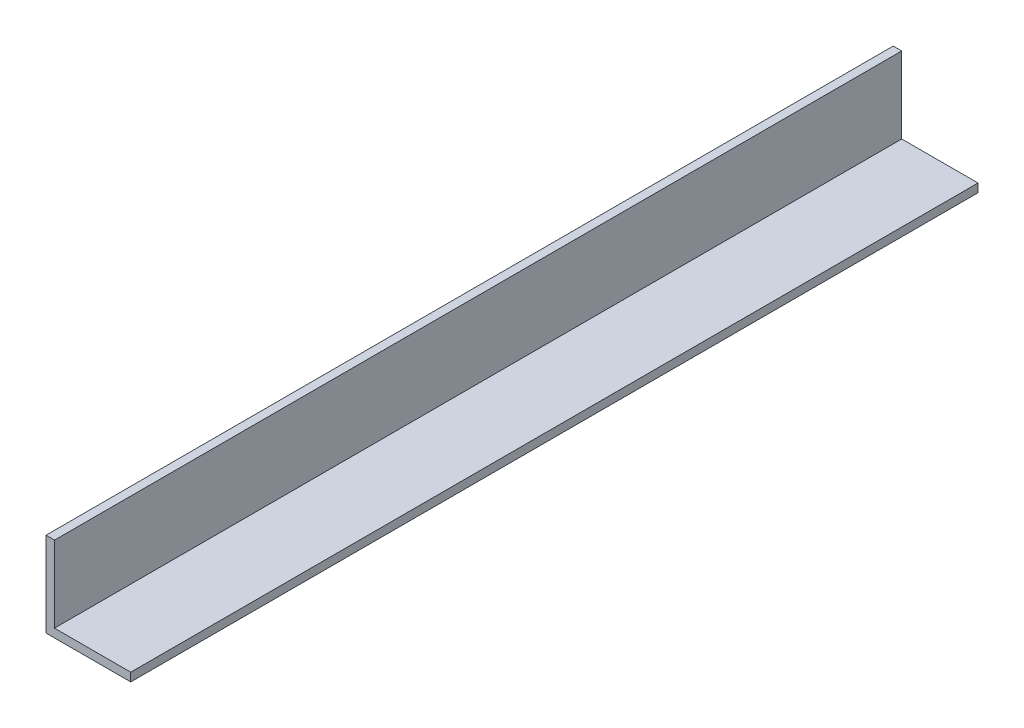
from build123d import *

# Parameters (mm, degrees)
EXTRUDE_1_DEPTH = 150


with BuildPart() as part:
    # Sketch 1 → Extrude 1 (new, symmetric)
    with BuildSketch(Plane.XY):
        Polygon((0, 0), (0, 27), (-3, 27), (-3, -3), (27, -3), (27, 0), align=None)
    extrude(amount=EXTRUDE_1_DEPTH, both=True)


solid = part.part
